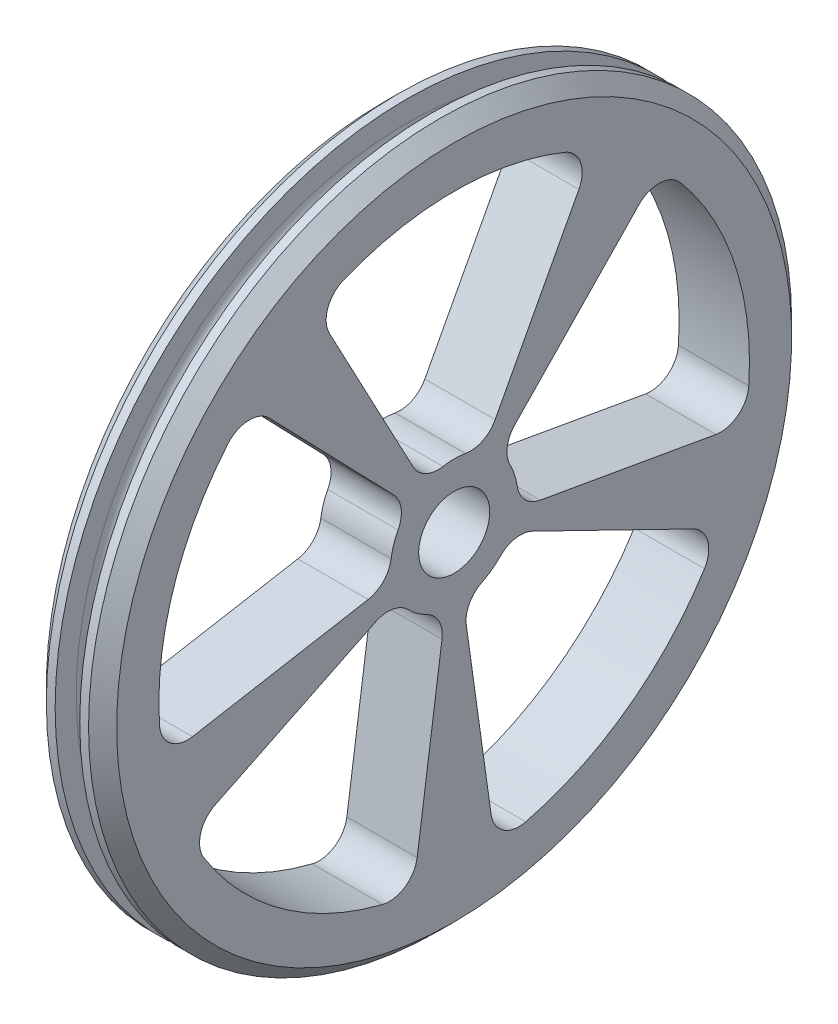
from build123d import *

# Parameters (mm, degrees)
CHANFREIN1_SIZE                    = 2
ENL_V_MAT_EXTRU_1_DEPTH            = 72.414284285
CONG_1_R                           = 4
R_P_TITION_CIRCULAIRE2_COUNT       = 5
CONG_1_OF_R_P_TITION_CIRCULAIRE2_R = 4


with BuildPart() as part:
    # Esquisse1 → R_volution2 (revolve)
    with BuildSketch(Plane.XY, mode=Mode.PRIVATE) as r_volution2_sk:
        with BuildLine():
            Line((1.75, 50), (1.75, 47))
            ThreePointArc((1.75, 47), (0, 45.25), (-1.75, 47))
            Line((-1.75, 47), (-1.75, 50))
            Line((-1.75, 50), (-5, 50))
            Line((-5, 50), (-5, 5.05))
            Line((-5, 5.05), (0, 5.05))
            Line((0, 5.05), (5, 5.05))
            Line((5, 5.05), (5, 50))
            Line((5, 50), (1.75, 50))
        make_face()
    revolve(r_volution2_sk.sketch.rotate(Axis((0, 0, 0), (1, 0, 0)), 180), axis=Axis((0, 0, 0), (1, 0, 0)))

    # Chanfrein1
    chanfrein1_edges = [part.edges().sort_by_distance(p)[0] for p in [
        (5, 50, 0),
        (-5, 50, 0),
    ]]
    chamfer(chanfrein1_edges, length=CHANFREIN1_SIZE)

    # Esquisse2 → Enl_v. mat.-Extru.1 (cut, through all)
    with BuildSketch(Plane.ZY.offset(5)):
        with BuildLine():
            Line((-4.248717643, 7.990675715), (-19.717805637, 37.0837989))
            ThreePointArc((-19.717805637, 37.0837989), (0, 42), (19.717805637, 37.0837989))
            Line((19.717805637, 37.0837989), (4.248717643, 7.990675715))
            ThreePointArc((4.248717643, 7.990675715), (0, 9.05), (-4.248717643, 7.990675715))
        make_face()
    enl_v_mat_extru_1 = extrude(amount=-ENL_V_MAT_EXTRU_1_DEPTH, mode=Mode.SUBTRACT)

    # Cong_1
    cong_1_edges = [part.edges().sort_by_distance(p)[0] for p in [
        (0, 7.990675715, 4.248717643),
        (0, 7.990675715, -4.248717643),
        (0, 37.0837989, -19.717805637),
        (0, 37.0837989, 19.717805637),
    ]]
    fillet(cong_1_edges, radius=CONG_1_R)

    # R_p_tition circulaire2: Enl_v. mat.-Extru.1 ×5 about axis
    r_p_tition_circulaire2_axis = Axis((0, 0, 0), (1, 0, 0))
    for i in range(1, R_P_TITION_CIRCULAIRE2_COUNT):
        add(enl_v_mat_extru_1.rotate(r_p_tition_circulaire2_axis, i * 360 / R_P_TITION_CIRCULAIRE2_COUNT), mode=Mode.SUBTRACT)

    # Cong_1 of R_p_tition circulaire2
    cong_1_of_r_p_tition_circulaire2_edges = [part.edges().sort_by_distance(p)[0] for p in [
        (0, -1.571516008, 8.912510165),
        (0, 6.510025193, 6.286658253),
        (0, 30.212271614, 29.175651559),
        (0, -7.293223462, 41.361925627),
        (0, -8.961926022, 1.259516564),
        (0, -3.967258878, 8.134086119),
        (0, -18.411588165, 37.749349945),
        (0, -41.591258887, 5.84527024),
        (0, -3.967258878, -8.134086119),
        (0, -8.961926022, -1.259516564),
        (0, -41.591258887, -5.84527024),
        (0, -18.411588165, -37.749349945),
        (0, 6.510025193, -6.286658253),
        (0, -1.571516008, -8.912510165),
        (0, -7.293223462, -41.361925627),
        (0, 30.212271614, -29.175651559),
    ]]
    fillet(cong_1_of_r_p_tition_circulaire2_edges, radius=CONG_1_OF_R_P_TITION_CIRCULAIRE2_R)


solid = part.part
